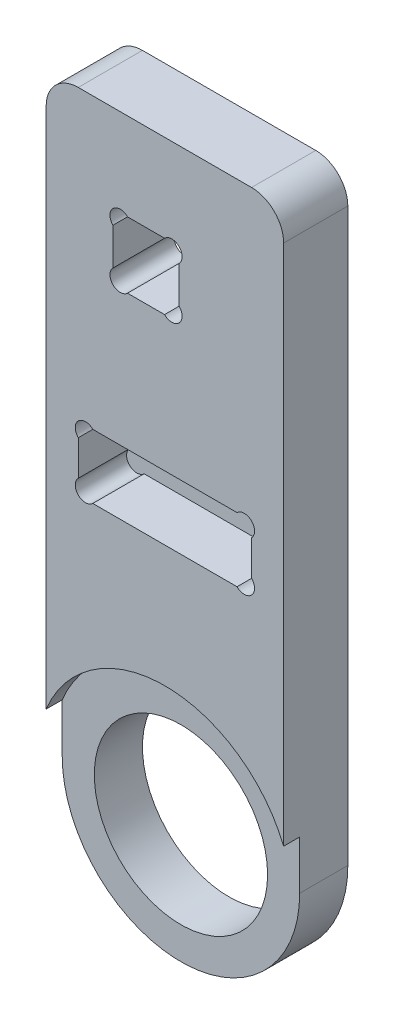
ISO-10303-21;
HEADER;
FILE_DESCRIPTION(('STEP AP214'),'2;1');
FILE_NAME('part.step','',(''),(''),'','','');
FILE_SCHEMA(('AUTOMOTIVE_DESIGN { 1 0 10303 214 1 1 1 1 }'));
ENDSEC;
DATA;
#1=APPLICATION_CONTEXT('core data for automotive mechanical design processes');
#2=APPLICATION_PROTOCOL_DEFINITION('international standard','automotive_design',2000,#1);
#3=PRODUCT_CONTEXT('',#1,'mechanical');
#4=PRODUCT('Part','Part','',(#3));
#5=PRODUCT_RELATED_PRODUCT_CATEGORY('part','',(#4));
#6=PRODUCT_DEFINITION_FORMATION('','',#4);
#7=PRODUCT_DEFINITION_CONTEXT('part definition',#1,'design');
#8=PRODUCT_DEFINITION('design','',#6,#7);
#9=PRODUCT_DEFINITION_SHAPE('','',#8);
#10=(LENGTH_UNIT() NAMED_UNIT(*) SI_UNIT(.MILLI.,.METRE.));
#11=(NAMED_UNIT(*) PLANE_ANGLE_UNIT() SI_UNIT($,.RADIAN.));
#12=(NAMED_UNIT(*) SI_UNIT($,.STERADIAN.) SOLID_ANGLE_UNIT());
#13=UNCERTAINTY_MEASURE_WITH_UNIT(LENGTH_MEASURE(1.E-05),#10,'distance_accuracy_value','');
#14=(GEOMETRIC_REPRESENTATION_CONTEXT(3) GLOBAL_UNCERTAINTY_ASSIGNED_CONTEXT((#13)) GLOBAL_UNIT_ASSIGNED_CONTEXT((#10,
#11,#12)) REPRESENTATION_CONTEXT('',''));
#15=CARTESIAN_POINT('',(0.,0.,0.));
#16=DIRECTION('',(0.,0.,1.));
#17=DIRECTION('',(1.,0.,0.));
#18=AXIS2_PLACEMENT_3D('',#15,#16,#17);
#19=CARTESIAN_POINT('',(0.,0.,10.));
#20=DIRECTION('',(0.,0.,-1.));
#21=DIRECTION('',(-1.,0.,0.));
#22=AXIS2_PLACEMENT_3D('',#19,#20,#21);
#23=CYLINDRICAL_SURFACE('',#22,18.5);
#24=CARTESIAN_POINT('',(0.,0.,7.5));
#25=DIRECTION('',(0.,0.,1.));
#26=DIRECTION('',(1.,0.,0.));
#27=AXIS2_PLACEMENT_3D('',#24,#25,#26);
#28=CIRCLE('',#27,18.5);
#29=CARTESIAN_POINT('',(-18.5,0.,7.5));
#30=VERTEX_POINT('',#29);
#31=CARTESIAN_POINT('',(18.5,0.,7.5));
#32=VERTEX_POINT('',#31);
#33=EDGE_CURVE('E283',#30,#32,#28,.T.);
#34=ORIENTED_EDGE('',*,*,#33,.F.);
#35=DIRECTION('',(0.,0.,1.));
#36=VECTOR('',#35,1.);
#37=CARTESIAN_POINT('',(-18.5,0.,0.));
#38=LINE('',#37,#36);
#39=CARTESIAN_POINT('',(-18.5,0.,0.));
#40=VERTEX_POINT('',#39);
#41=EDGE_CURVE('E368',#40,#30,#38,.T.);
#42=ORIENTED_EDGE('',*,*,#41,.F.);
#43=CARTESIAN_POINT('',(0.,0.,0.));
#44=DIRECTION('',(0.,0.,1.));
#45=DIRECTION('',(1.,0.,0.));
#46=AXIS2_PLACEMENT_3D('',#43,#44,#45);
#47=CIRCLE('',#46,18.5);
#48=CARTESIAN_POINT('',(18.5,0.,0.));
#49=VERTEX_POINT('',#48);
#50=EDGE_CURVE('E371',#40,#49,#47,.T.);
#51=ORIENTED_EDGE('',*,*,#50,.T.);
#52=DIRECTION('',(0.,0.,1.));
#53=VECTOR('',#52,1.);
#54=CARTESIAN_POINT('',(18.5,0.,0.));
#55=LINE('',#54,#53);
#56=EDGE_CURVE('E364',#49,#32,#55,.T.);
#57=ORIENTED_EDGE('',*,*,#56,.T.);
#58=EDGE_LOOP('',(#34,#42,#51,#57));
#59=FACE_BOUND('',#58,.T.);
#60=ADVANCED_FACE('F32',(#59),#23,.T.);
#61=CARTESIAN_POINT('',(0.,0.,0.));
#62=DIRECTION('',(0.,0.,1.));
#63=DIRECTION('',(1.,0.,0.));
#64=AXIS2_PLACEMENT_3D('',#61,#62,#63);
#65=CYLINDRICAL_SURFACE('',#64,13.5);
#66=CARTESIAN_POINT('',(0.,0.,0.));
#67=DIRECTION('',(0.,0.,1.));
#68=DIRECTION('',(1.,0.,0.));
#69=AXIS2_PLACEMENT_3D('',#66,#67,#68);
#70=CIRCLE('',#69,13.5);
#71=CARTESIAN_POINT('',(13.5,0.,0.));
#72=VERTEX_POINT('',#71);
#73=EDGE_CURVE('E340',#72,#72,#70,.T.);
#74=ORIENTED_EDGE('',*,*,#73,.F.);
#75=EDGE_LOOP('',(#74));
#76=FACE_BOUND('',#75,.T.);
#77=CARTESIAN_POINT('',(0.,0.,7.5));
#78=DIRECTION('',(0.,0.,1.));
#79=DIRECTION('',(1.,0.,0.));
#80=AXIS2_PLACEMENT_3D('',#77,#78,#79);
#81=CIRCLE('',#80,13.5);
#82=CARTESIAN_POINT('',(13.5,0.,7.5));
#83=VERTEX_POINT('',#82);
#84=EDGE_CURVE('E277',#83,#83,#81,.F.);
#85=ORIENTED_EDGE('',*,*,#84,.F.);
#86=EDGE_LOOP('',(#85));
#87=FACE_BOUND('',#86,.T.);
#88=ADVANCED_FACE('F424',(#76,#87),#65,.F.);
#89=CARTESIAN_POINT('',(0.,0.,10.));
#90=DIRECTION('',(0.,0.,1.));
#91=DIRECTION('',(1.,0.,0.));
#92=AXIS2_PLACEMENT_3D('',#89,#90,#91);
#93=PLANE('',#92);
#94=DIRECTION('',(0.,1.,0.));
#95=VECTOR('',#94,1.);
#96=CARTESIAN_POINT('',(18.5,94.98,10.));
#97=LINE('',#96,#95);
#98=CARTESIAN_POINT('',(18.5,7.59934207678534,10.));
#99=VERTEX_POINT('',#98);
#100=CARTESIAN_POINT('',(18.5,88.98,10.));
#101=VERTEX_POINT('',#100);
#102=EDGE_CURVE('E357',#99,#101,#97,.T.);
#103=ORIENTED_EDGE('',*,*,#102,.T.);
#104=CARTESIAN_POINT('',(13.5,88.98,10.));
#105=DIRECTION('',(0.,0.,1.));
#106=DIRECTION('',(1.,0.,0.));
#107=AXIS2_PLACEMENT_3D('',#104,#105,#106);
#108=CIRCLE('',#107,5.);
#109=CARTESIAN_POINT('',(13.5,93.98,10.));
#110=VERTEX_POINT('',#109);
#111=EDGE_CURVE('E385',#101,#110,#108,.T.);
#112=ORIENTED_EDGE('',*,*,#111,.T.);
#113=DIRECTION('',(1.,0.,0.));
#114=VECTOR('',#113,1.);
#115=CARTESIAN_POINT('',(-18.5,93.98,10.));
#116=LINE('',#115,#114);
#117=CARTESIAN_POINT('',(-13.5,93.98,10.));
#118=VERTEX_POINT('',#117);
#119=EDGE_CURVE('E226',#118,#110,#116,.T.);
#120=ORIENTED_EDGE('',*,*,#119,.F.);
#121=CARTESIAN_POINT('',(-13.5,88.98,10.));
#122=DIRECTION('',(0.,0.,1.));
#123=DIRECTION('',(1.,0.,0.));
#124=AXIS2_PLACEMENT_3D('',#121,#122,#123);
#125=CIRCLE('',#124,5.);
#126=CARTESIAN_POINT('',(-18.5,88.98,10.));
#127=VERTEX_POINT('',#126);
#128=EDGE_CURVE('E383',#118,#127,#125,.T.);
#129=ORIENTED_EDGE('',*,*,#128,.T.);
#130=DIRECTION('',(0.,-1.,0.));
#131=VECTOR('',#130,1.);
#132=CARTESIAN_POINT('',(-18.5,0.,10.));
#133=LINE('',#132,#131);
#134=CARTESIAN_POINT('',(-18.5,7.59934207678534,10.));
#135=VERTEX_POINT('',#134);
#136=EDGE_CURVE('E362',#127,#135,#133,.T.);
#137=ORIENTED_EDGE('',*,*,#136,.T.);
#138=CARTESIAN_POINT('',(0.,0.,10.));
#139=DIRECTION('',(0.,0.,1.));
#140=DIRECTION('',(1.,0.,0.));
#141=AXIS2_PLACEMENT_3D('',#138,#139,#140);
#142=CIRCLE('',#141,20.);
#143=EDGE_CURVE('E262',#99,#135,#142,.T.);
#144=ORIENTED_EDGE('',*,*,#143,.F.);
#145=EDGE_LOOP('',(#103,#112,#120,#129,#137,#144));
#146=FACE_BOUND('',#145,.T.);
#147=CARTESIAN_POINT('',(-6.961438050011,79.2224839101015,10.));
#148=DIRECTION('',(0.,0.,1.));
#149=DIRECTION('',(-1.,0.,0.));
#150=AXIS2_PLACEMENT_3D('',#147,#148,#149);
#151=CIRCLE('',#150,1.59999999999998);
#152=CARTESIAN_POINT('',(-5.83006720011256,80.35385476,10.));
#153=VERTEX_POINT('',#152);
#154=CARTESIAN_POINT('',(-8.09280889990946,78.0911130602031,10.));
#155=VERTEX_POINT('',#154);
#156=EDGE_CURVE('E201',#153,#155,#151,.T.);
#157=ORIENTED_EDGE('',*,*,#156,.F.);
#158=DIRECTION('',(-1.,0.,0.));
#159=VECTOR('',#158,1.);
#160=CARTESIAN_POINT('',(-5.83006720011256,80.35385476,10.));
#161=LINE('',#160,#159);
#162=CARTESIAN_POINT('',(-0.0555505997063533,80.35385476,10.));
#163=VERTEX_POINT('',#162);
#164=EDGE_CURVE('E220',#163,#153,#161,.T.);
#165=ORIENTED_EDGE('',*,*,#164,.F.);
#166=CARTESIAN_POINT('',(1.07582025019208,79.2224839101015,10.));
#167=DIRECTION('',(0.,0.,1.));
#168=DIRECTION('',(1.,0.,0.));
#169=AXIS2_PLACEMENT_3D('',#166,#167,#168);
#170=CIRCLE('',#169,1.59999999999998);
#171=CARTESIAN_POINT('',(2.20719110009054,78.0911130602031,10.));
#172=VERTEX_POINT('',#171);
#173=EDGE_CURVE('E223',#172,#163,#170,.T.);
#174=ORIENTED_EDGE('',*,*,#173,.F.);
#175=DIRECTION('',(0.,1.,0.));
#176=VECTOR('',#175,1.);
#177=CARTESIAN_POINT('',(2.20719110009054,78.0911130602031,10.));
#178=LINE('',#177,#176);
#179=CARTESIAN_POINT('',(2.20719110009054,72.3165964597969,10.));
#180=VERTEX_POINT('',#179);
#181=EDGE_CURVE('E255',#180,#172,#178,.T.);
#182=ORIENTED_EDGE('',*,*,#181,.F.);
#183=CARTESIAN_POINT('',(1.07582025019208,71.1852256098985,10.));
#184=DIRECTION('',(0.,0.,1.));
#185=DIRECTION('',(-1.,0.,0.));
#186=AXIS2_PLACEMENT_3D('',#183,#184,#185);
#187=CIRCLE('',#186,1.59999999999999);
#188=CARTESIAN_POINT('',(-0.0555505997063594,70.05385476,10.));
#189=VERTEX_POINT('',#188);
#190=EDGE_CURVE('E252',#189,#180,#187,.T.);
#191=ORIENTED_EDGE('',*,*,#190,.F.);
#192=DIRECTION('',(1.,0.,0.));
#193=VECTOR('',#192,1.);
#194=CARTESIAN_POINT('',(-5.83006720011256,70.05385476,10.));
#195=LINE('',#194,#193);
#196=CARTESIAN_POINT('',(-5.83006720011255,70.05385476,10.));
#197=VERTEX_POINT('',#196);
#198=EDGE_CURVE('E249',#197,#189,#195,.T.);
#199=ORIENTED_EDGE('',*,*,#198,.F.);
#200=CARTESIAN_POINT('',(-6.961438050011,71.1852256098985,10.));
#201=DIRECTION('',(0.,0.,1.));
#202=DIRECTION('',(1.,0.,0.));
#203=AXIS2_PLACEMENT_3D('',#200,#201,#202);
#204=CIRCLE('',#203,1.59999999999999);
#205=CARTESIAN_POINT('',(-8.09280889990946,72.316596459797,10.));
#206=VERTEX_POINT('',#205);
#207=EDGE_CURVE('E246',#206,#197,#204,.T.);
#208=ORIENTED_EDGE('',*,*,#207,.F.);
#209=DIRECTION('',(0.,-1.,0.));
#210=VECTOR('',#209,1.);
#211=CARTESIAN_POINT('',(-8.09280889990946,78.0911130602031,10.));
#212=LINE('',#211,#210);
#213=EDGE_CURVE('E243',#155,#206,#212,.T.);
#214=ORIENTED_EDGE('',*,*,#213,.F.);
#215=EDGE_LOOP('',(#157,#165,#174,#182,#191,#199,#208,#214));
#216=FACE_BOUND('',#215,.T.);
#217=CARTESIAN_POINT('',(-12.3686291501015,47.8486291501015,10.));
#218=DIRECTION('',(0.,0.,1.));
#219=DIRECTION('',(1.,0.,0.));
#220=AXIS2_PLACEMENT_3D('',#217,#218,#219);
#221=CIRCLE('',#220,1.6);
#222=CARTESIAN_POINT('',(-11.2372583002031,48.98,10.));
#223=VERTEX_POINT('',#222);
#224=CARTESIAN_POINT('',(-13.5,46.717258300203,10.));
#225=VERTEX_POINT('',#224);
#226=EDGE_CURVE('E290',#223,#225,#221,.T.);
#227=ORIENTED_EDGE('',*,*,#226,.F.);
#228=DIRECTION('',(-1.,0.,0.));
#229=VECTOR('',#228,1.);
#230=CARTESIAN_POINT('',(-11.2372583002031,48.98,10.));
#231=LINE('',#230,#229);
#232=CARTESIAN_POINT('',(11.2372583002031,48.98,10.));
#233=VERTEX_POINT('',#232);
#234=EDGE_CURVE('E295',#233,#223,#231,.T.);
#235=ORIENTED_EDGE('',*,*,#234,.F.);
#236=CARTESIAN_POINT('',(12.3686291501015,47.8486291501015,10.));
#237=DIRECTION('',(0.,0.,1.));
#238=DIRECTION('',(-1.,0.,0.));
#239=AXIS2_PLACEMENT_3D('',#236,#237,#238);
#240=CIRCLE('',#239,1.6);
#241=CARTESIAN_POINT('',(13.5,46.7172583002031,10.));
#242=VERTEX_POINT('',#241);
#243=EDGE_CURVE('E333',#242,#233,#240,.T.);
#244=ORIENTED_EDGE('',*,*,#243,.F.);
#245=DIRECTION('',(0.,1.,0.));
#246=VECTOR('',#245,1.);
#247=CARTESIAN_POINT('',(13.5,46.7172583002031,10.));
#248=LINE('',#247,#246);
#249=CARTESIAN_POINT('',(13.5,41.242741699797,10.));
#250=VERTEX_POINT('',#249);
#251=EDGE_CURVE('E330',#250,#242,#248,.T.);
#252=ORIENTED_EDGE('',*,*,#251,.F.);
#253=CARTESIAN_POINT('',(12.3686291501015,40.1113708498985,10.));
#254=DIRECTION('',(0.,0.,1.));
#255=DIRECTION('',(1.,0.,0.));
#256=AXIS2_PLACEMENT_3D('',#253,#254,#255);
#257=CIRCLE('',#256,1.6);
#258=CARTESIAN_POINT('',(11.2372583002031,38.98,10.));
#259=VERTEX_POINT('',#258);
#260=EDGE_CURVE('E327',#259,#250,#257,.T.);
#261=ORIENTED_EDGE('',*,*,#260,.F.);
#262=DIRECTION('',(1.,0.,0.));
#263=VECTOR('',#262,1.);
#264=CARTESIAN_POINT('',(-11.2372583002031,38.98,10.));
#265=LINE('',#264,#263);
#266=CARTESIAN_POINT('',(-11.2372583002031,38.98,10.));
#267=VERTEX_POINT('',#266);
#268=EDGE_CURVE('E324',#267,#259,#265,.T.);
#269=ORIENTED_EDGE('',*,*,#268,.F.);
#270=CARTESIAN_POINT('',(-12.3686291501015,40.1113708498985,10.));
#271=DIRECTION('',(0.,0.,1.));
#272=DIRECTION('',(-1.,0.,0.));
#273=AXIS2_PLACEMENT_3D('',#270,#271,#272);
#274=CIRCLE('',#273,1.6);
#275=CARTESIAN_POINT('',(-13.5,41.242741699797,10.));
#276=VERTEX_POINT('',#275);
#277=EDGE_CURVE('E321',#276,#267,#274,.T.);
#278=ORIENTED_EDGE('',*,*,#277,.F.);
#279=DIRECTION('',(0.,-1.,0.));
#280=VECTOR('',#279,1.);
#281=CARTESIAN_POINT('',(-13.5,46.717258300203,10.));
#282=LINE('',#281,#280);
#283=EDGE_CURVE('E318',#225,#276,#282,.T.);
#284=ORIENTED_EDGE('',*,*,#283,.F.);
#285=EDGE_LOOP('',(#227,#235,#244,#252,#261,#269,#278,#284));
#286=FACE_BOUND('',#285,.T.);
#287=ADVANCED_FACE('F404',(#146,#216,#286),#93,.T.);
#288=CARTESIAN_POINT('',(0.,0.,0.));
#289=DIRECTION('',(0.,0.,1.));
#290=DIRECTION('',(1.,0.,0.));
#291=AXIS2_PLACEMENT_3D('',#288,#289,#290);
#292=PLANE('',#291);
#293=DIRECTION('',(-1.,0.,0.));
#294=VECTOR('',#293,1.);
#295=CARTESIAN_POINT('',(-5.83006720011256,80.35385476,0.));
#296=LINE('',#295,#294);
#297=CARTESIAN_POINT('',(-0.0555505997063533,80.35385476,0.));
#298=VERTEX_POINT('',#297);
#299=CARTESIAN_POINT('',(-5.83006720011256,80.35385476,0.));
#300=VERTEX_POINT('',#299);
#301=EDGE_CURVE('E206',#298,#300,#296,.T.);
#302=ORIENTED_EDGE('',*,*,#301,.T.);
#303=CARTESIAN_POINT('',(-6.961438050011,79.2224839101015,0.));
#304=DIRECTION('',(0.,0.,1.));
#305=DIRECTION('',(-1.,0.,0.));
#306=AXIS2_PLACEMENT_3D('',#303,#304,#305);
#307=CIRCLE('',#306,1.59999999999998);
#308=CARTESIAN_POINT('',(-8.09280889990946,78.0911130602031,0.));
#309=VERTEX_POINT('',#308);
#310=EDGE_CURVE('E198',#300,#309,#307,.T.);
#311=ORIENTED_EDGE('',*,*,#310,.T.);
#312=DIRECTION('',(0.,-1.,0.));
#313=VECTOR('',#312,1.);
#314=CARTESIAN_POINT('',(-8.09280889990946,78.0911130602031,0.));
#315=LINE('',#314,#313);
#316=CARTESIAN_POINT('',(-8.09280889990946,72.316596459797,0.));
#317=VERTEX_POINT('',#316);
#318=EDGE_CURVE('E210',#309,#317,#315,.T.);
#319=ORIENTED_EDGE('',*,*,#318,.T.);
#320=CARTESIAN_POINT('',(-6.961438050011,71.1852256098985,0.));
#321=DIRECTION('',(0.,0.,1.));
#322=DIRECTION('',(1.,0.,0.));
#323=AXIS2_PLACEMENT_3D('',#320,#321,#322);
#324=CIRCLE('',#323,1.59999999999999);
#325=CARTESIAN_POINT('',(-5.83006720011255,70.05385476,0.));
#326=VERTEX_POINT('',#325);
#327=EDGE_CURVE('E214',#317,#326,#324,.T.);
#328=ORIENTED_EDGE('',*,*,#327,.T.);
#329=DIRECTION('',(1.,0.,0.));
#330=VECTOR('',#329,1.);
#331=CARTESIAN_POINT('',(-5.83006720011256,70.05385476,0.));
#332=LINE('',#331,#330);
#333=CARTESIAN_POINT('',(-0.0555505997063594,70.05385476,0.));
#334=VERTEX_POINT('',#333);
#335=EDGE_CURVE('E230',#326,#334,#332,.T.);
#336=ORIENTED_EDGE('',*,*,#335,.T.);
#337=CARTESIAN_POINT('',(1.07582025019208,71.1852256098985,0.));
#338=DIRECTION('',(0.,0.,1.));
#339=DIRECTION('',(-1.,0.,0.));
#340=AXIS2_PLACEMENT_3D('',#337,#338,#339);
#341=CIRCLE('',#340,1.59999999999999);
#342=CARTESIAN_POINT('',(2.20719110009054,72.3165964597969,0.));
#343=VERTEX_POINT('',#342);
#344=EDGE_CURVE('E233',#334,#343,#341,.T.);
#345=ORIENTED_EDGE('',*,*,#344,.T.);
#346=DIRECTION('',(0.,1.,0.));
#347=VECTOR('',#346,1.);
#348=CARTESIAN_POINT('',(2.20719110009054,78.0911130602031,0.));
#349=LINE('',#348,#347);
#350=CARTESIAN_POINT('',(2.20719110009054,78.0911130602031,0.));
#351=VERTEX_POINT('',#350);
#352=EDGE_CURVE('E236',#343,#351,#349,.T.);
#353=ORIENTED_EDGE('',*,*,#352,.T.);
#354=CARTESIAN_POINT('',(1.07582025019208,79.2224839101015,0.));
#355=DIRECTION('',(0.,0.,1.));
#356=DIRECTION('',(1.,0.,0.));
#357=AXIS2_PLACEMENT_3D('',#354,#355,#356);
#358=CIRCLE('',#357,1.59999999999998);
#359=EDGE_CURVE('E239',#351,#298,#358,.T.);
#360=ORIENTED_EDGE('',*,*,#359,.T.);
#361=EDGE_LOOP('',(#302,#311,#319,#328,#336,#345,#353,#360));
#362=FACE_BOUND('',#361,.T.);
#363=ORIENTED_EDGE('',*,*,#73,.T.);
#364=EDGE_LOOP('',(#363));
#365=FACE_BOUND('',#364,.T.);
#366=DIRECTION('',(1.,0.,0.));
#367=VECTOR('',#366,1.);
#368=CARTESIAN_POINT('',(-18.5,93.98,0.));
#369=LINE('',#368,#367);
#370=CARTESIAN_POINT('',(-13.5,93.98,0.));
#371=VERTEX_POINT('',#370);
#372=CARTESIAN_POINT('',(13.5,93.98,0.));
#373=VERTEX_POINT('',#372);
#374=EDGE_CURVE('E244',#371,#373,#369,.T.);
#375=ORIENTED_EDGE('',*,*,#374,.T.);
#376=CARTESIAN_POINT('',(13.5,88.98,0.));
#377=DIRECTION('',(0.,0.,1.));
#378=DIRECTION('',(1.,0.,0.));
#379=AXIS2_PLACEMENT_3D('',#376,#377,#378);
#380=CIRCLE('',#379,5.);
#381=CARTESIAN_POINT('',(18.5,88.98,0.));
#382=VERTEX_POINT('',#381);
#383=EDGE_CURVE('E40',#373,#382,#380,.F.);
#384=ORIENTED_EDGE('',*,*,#383,.T.);
#385=DIRECTION('',(0.,1.,0.));
#386=VECTOR('',#385,1.);
#387=CARTESIAN_POINT('',(18.5,94.98,0.));
#388=LINE('',#387,#386);
#389=EDGE_CURVE('E358',#49,#382,#388,.T.);
#390=ORIENTED_EDGE('',*,*,#389,.F.);
#391=ORIENTED_EDGE('',*,*,#50,.F.);
#392=DIRECTION('',(0.,-1.,0.));
#393=VECTOR('',#392,1.);
#394=CARTESIAN_POINT('',(-18.5,0.,0.));
#395=LINE('',#394,#393);
#396=CARTESIAN_POINT('',(-18.5,88.98,0.));
#397=VERTEX_POINT('',#396);
#398=EDGE_CURVE('E361',#397,#40,#395,.T.);
#399=ORIENTED_EDGE('',*,*,#398,.F.);
#400=CARTESIAN_POINT('',(-13.5,88.98,0.));
#401=DIRECTION('',(0.,0.,1.));
#402=DIRECTION('',(1.,0.,0.));
#403=AXIS2_PLACEMENT_3D('',#400,#401,#402);
#404=CIRCLE('',#403,5.);
#405=EDGE_CURVE('E391',#397,#371,#404,.F.);
#406=ORIENTED_EDGE('',*,*,#405,.T.);
#407=EDGE_LOOP('',(#375,#384,#390,#391,#399,#406));
#408=FACE_BOUND('',#407,.T.);
#409=ADVANCED_FACE('F216',(#362,#365,#408),#292,.F.);
#410=CARTESIAN_POINT('',(-18.5,0.,0.));
#411=DIRECTION('',(-1.,0.,0.));
#412=DIRECTION('',(0.,-1.,0.));
#413=AXIS2_PLACEMENT_3D('',#410,#411,#412);
#414=PLANE('',#413);
#415=ORIENTED_EDGE('',*,*,#136,.F.);
#416=DIRECTION('',(0.,0.,1.));
#417=VECTOR('',#416,1.);
#418=CARTESIAN_POINT('',(-18.5,88.98,0.));
#419=LINE('',#418,#417);
#420=EDGE_CURVE('E11',#127,#397,#419,.F.);
#421=ORIENTED_EDGE('',*,*,#420,.T.);
#422=ORIENTED_EDGE('',*,*,#398,.T.);
#423=ORIENTED_EDGE('',*,*,#41,.T.);
#424=DIRECTION('',(0.,1.,0.));
#425=VECTOR('',#424,1.);
#426=CARTESIAN_POINT('',(-18.5,0.,7.5));
#427=LINE('',#426,#425);
#428=CARTESIAN_POINT('',(-18.5,7.59934207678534,7.5));
#429=VERTEX_POINT('',#428);
#430=EDGE_CURVE('E285',#30,#429,#427,.T.);
#431=ORIENTED_EDGE('',*,*,#430,.T.);
#432=DIRECTION('',(0.,0.,1.));
#433=VECTOR('',#432,1.);
#434=CARTESIAN_POINT('',(-18.5,7.59934207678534,7.5));
#435=LINE('',#434,#433);
#436=EDGE_CURVE('E288',#135,#429,#435,.F.);
#437=ORIENTED_EDGE('',*,*,#436,.F.);
#438=EDGE_LOOP('',(#415,#421,#422,#423,#431,#437));
#439=FACE_BOUND('',#438,.T.);
#440=ADVANCED_FACE('F412',(#439),#414,.T.);
#441=CARTESIAN_POINT('',(18.5,94.98,0.));
#442=DIRECTION('',(1.,0.,0.));
#443=DIRECTION('',(0.,1.,0.));
#444=AXIS2_PLACEMENT_3D('',#441,#442,#443);
#445=PLANE('',#444);
#446=ORIENTED_EDGE('',*,*,#389,.T.);
#447=DIRECTION('',(0.,0.,1.));
#448=VECTOR('',#447,1.);
#449=CARTESIAN_POINT('',(18.5,88.98,10.));
#450=LINE('',#449,#448);
#451=EDGE_CURVE('E380',#382,#101,#450,.T.);
#452=ORIENTED_EDGE('',*,*,#451,.T.);
#453=ORIENTED_EDGE('',*,*,#102,.F.);
#454=DIRECTION('',(0.,0.,1.));
#455=VECTOR('',#454,1.);
#456=CARTESIAN_POINT('',(18.5,7.59934207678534,7.5));
#457=LINE('',#456,#455);
#458=CARTESIAN_POINT('',(18.5,7.59934207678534,7.5));
#459=VERTEX_POINT('',#458);
#460=EDGE_CURVE('E376',#459,#99,#457,.T.);
#461=ORIENTED_EDGE('',*,*,#460,.F.);
#462=DIRECTION('',(0.,-1.,0.));
#463=VECTOR('',#462,1.);
#464=CARTESIAN_POINT('',(18.5,94.98,7.5));
#465=LINE('',#464,#463);
#466=EDGE_CURVE('E280',#459,#32,#465,.T.);
#467=ORIENTED_EDGE('',*,*,#466,.T.);
#468=ORIENTED_EDGE('',*,*,#56,.F.);
#469=EDGE_LOOP('',(#446,#452,#453,#461,#467,#468));
#470=FACE_BOUND('',#469,.T.);
#471=ADVANCED_FACE('F399',(#470),#445,.T.);
#472=CARTESIAN_POINT('',(-12.3686291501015,47.8486291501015,2.));
#473=DIRECTION('',(0.,0.,1.));
#474=DIRECTION('',(1.,0.,0.));
#475=AXIS2_PLACEMENT_3D('',#472,#473,#474);
#476=CYLINDRICAL_SURFACE('',#475,1.6);
#477=ORIENTED_EDGE('',*,*,#226,.T.);
#478=DIRECTION('',(0.,0.,1.));
#479=VECTOR('',#478,1.);
#480=CARTESIAN_POINT('',(-13.5,46.717258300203,2.));
#481=LINE('',#480,#479);
#482=CARTESIAN_POINT('',(-13.5,46.717258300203,2.));
#483=VERTEX_POINT('',#482);
#484=EDGE_CURVE('E316',#483,#225,#481,.T.);
#485=ORIENTED_EDGE('',*,*,#484,.F.);
#486=CARTESIAN_POINT('',(-12.3686291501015,47.8486291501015,2.));
#487=DIRECTION('',(0.,0.,1.));
#488=DIRECTION('',(1.,0.,0.));
#489=AXIS2_PLACEMENT_3D('',#486,#487,#488);
#490=CIRCLE('',#489,1.6);
#491=CARTESIAN_POINT('',(-11.2372583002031,48.98,2.));
#492=VERTEX_POINT('',#491);
#493=EDGE_CURVE('E291',#492,#483,#490,.T.);
#494=ORIENTED_EDGE('',*,*,#493,.F.);
#495=DIRECTION('',(0.,0.,1.));
#496=VECTOR('',#495,1.);
#497=CARTESIAN_POINT('',(-11.2372583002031,48.98,2.));
#498=LINE('',#497,#496);
#499=EDGE_CURVE('E338',#492,#223,#498,.T.);
#500=ORIENTED_EDGE('',*,*,#499,.T.);
#501=EDGE_LOOP('',(#477,#485,#494,#500));
#502=FACE_BOUND('',#501,.T.);
#503=ADVANCED_FACE('F483',(#502),#476,.F.);
#504=CARTESIAN_POINT('',(-11.2372583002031,48.98,2.));
#505=DIRECTION('',(0.,1.,0.));
#506=DIRECTION('',(-1.,0.,0.));
#507=AXIS2_PLACEMENT_3D('',#504,#505,#506);
#508=PLANE('',#507);
#509=ORIENTED_EDGE('',*,*,#234,.T.);
#510=ORIENTED_EDGE('',*,*,#499,.F.);
#511=DIRECTION('',(-1.,0.,0.));
#512=VECTOR('',#511,1.);
#513=CARTESIAN_POINT('',(-11.2372583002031,48.98,2.));
#514=LINE('',#513,#512);
#515=CARTESIAN_POINT('',(11.2372583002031,48.98,2.));
#516=VERTEX_POINT('',#515);
#517=EDGE_CURVE('E313',#516,#492,#514,.T.);
#518=ORIENTED_EDGE('',*,*,#517,.F.);
#519=DIRECTION('',(0.,0.,1.));
#520=VECTOR('',#519,1.);
#521=CARTESIAN_POINT('',(11.2372583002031,48.98,2.));
#522=LINE('',#521,#520);
#523=EDGE_CURVE('E341',#516,#233,#522,.T.);
#524=ORIENTED_EDGE('',*,*,#523,.T.);
#525=EDGE_LOOP('',(#509,#510,#518,#524));
#526=FACE_BOUND('',#525,.T.);
#527=ADVANCED_FACE('F479',(#526),#508,.F.);
#528=CARTESIAN_POINT('',(12.3686291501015,47.8486291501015,2.));
#529=DIRECTION('',(0.,0.,1.));
#530=DIRECTION('',(1.,0.,0.));
#531=AXIS2_PLACEMENT_3D('',#528,#529,#530);
#532=CYLINDRICAL_SURFACE('',#531,1.6);
#533=ORIENTED_EDGE('',*,*,#243,.T.);
#534=ORIENTED_EDGE('',*,*,#523,.F.);
#535=CARTESIAN_POINT('',(12.3686291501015,47.8486291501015,2.));
#536=DIRECTION('',(0.,0.,1.));
#537=DIRECTION('',(-1.,0.,0.));
#538=AXIS2_PLACEMENT_3D('',#535,#536,#537);
#539=CIRCLE('',#538,1.6);
#540=CARTESIAN_POINT('',(13.5,46.7172583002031,2.));
#541=VERTEX_POINT('',#540);
#542=EDGE_CURVE('E310',#541,#516,#539,.T.);
#543=ORIENTED_EDGE('',*,*,#542,.F.);
#544=DIRECTION('',(0.,0.,1.));
#545=VECTOR('',#544,1.);
#546=CARTESIAN_POINT('',(13.5,46.7172583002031,2.));
#547=LINE('',#546,#545);
#548=EDGE_CURVE('E343',#541,#242,#547,.T.);
#549=ORIENTED_EDGE('',*,*,#548,.T.);
#550=EDGE_LOOP('',(#533,#534,#543,#549));
#551=FACE_BOUND('',#550,.T.);
#552=ADVANCED_FACE('F482',(#551),#532,.F.);
#553=CARTESIAN_POINT('',(13.5,46.7172583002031,2.));
#554=DIRECTION('',(1.,0.,0.));
#555=DIRECTION('',(0.,1.,0.));
#556=AXIS2_PLACEMENT_3D('',#553,#554,#555);
#557=PLANE('',#556);
#558=ORIENTED_EDGE('',*,*,#251,.T.);
#559=ORIENTED_EDGE('',*,*,#548,.F.);
#560=DIRECTION('',(0.,1.,0.));
#561=VECTOR('',#560,1.);
#562=CARTESIAN_POINT('',(13.5,46.7172583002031,2.));
#563=LINE('',#562,#561);
#564=CARTESIAN_POINT('',(13.5,41.242741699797,2.));
#565=VERTEX_POINT('',#564);
#566=EDGE_CURVE('E307',#565,#541,#563,.T.);
#567=ORIENTED_EDGE('',*,*,#566,.F.);
#568=DIRECTION('',(0.,0.,1.));
#569=VECTOR('',#568,1.);
#570=CARTESIAN_POINT('',(13.5,41.242741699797,2.));
#571=LINE('',#570,#569);
#572=EDGE_CURVE('E345',#565,#250,#571,.T.);
#573=ORIENTED_EDGE('',*,*,#572,.T.);
#574=EDGE_LOOP('',(#558,#559,#567,#573));
#575=FACE_BOUND('',#574,.T.);
#576=ADVANCED_FACE('F487',(#575),#557,.F.);
#577=CARTESIAN_POINT('',(12.3686291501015,40.1113708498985,2.));
#578=DIRECTION('',(0.,0.,1.));
#579=DIRECTION('',(1.,0.,0.));
#580=AXIS2_PLACEMENT_3D('',#577,#578,#579);
#581=CYLINDRICAL_SURFACE('',#580,1.6);
#582=ORIENTED_EDGE('',*,*,#260,.T.);
#583=ORIENTED_EDGE('',*,*,#572,.F.);
#584=CARTESIAN_POINT('',(12.3686291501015,40.1113708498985,2.));
#585=DIRECTION('',(0.,0.,1.));
#586=DIRECTION('',(1.,0.,0.));
#587=AXIS2_PLACEMENT_3D('',#584,#585,#586);
#588=CIRCLE('',#587,1.6);
#589=CARTESIAN_POINT('',(11.2372583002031,38.98,2.));
#590=VERTEX_POINT('',#589);
#591=EDGE_CURVE('E304',#590,#565,#588,.T.);
#592=ORIENTED_EDGE('',*,*,#591,.F.);
#593=DIRECTION('',(0.,0.,1.));
#594=VECTOR('',#593,1.);
#595=CARTESIAN_POINT('',(11.2372583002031,38.98,2.));
#596=LINE('',#595,#594);
#597=EDGE_CURVE('E347',#590,#259,#596,.T.);
#598=ORIENTED_EDGE('',*,*,#597,.T.);
#599=EDGE_LOOP('',(#582,#583,#592,#598));
#600=FACE_BOUND('',#599,.T.);
#601=ADVANCED_FACE('F491',(#600),#581,.F.);
#602=CARTESIAN_POINT('',(-11.2372583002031,38.98,2.));
#603=DIRECTION('',(0.,-1.,0.));
#604=DIRECTION('',(0.,0.,-1.));
#605=AXIS2_PLACEMENT_3D('',#602,#603,#604);
#606=PLANE('',#605);
#607=ORIENTED_EDGE('',*,*,#268,.T.);
#608=ORIENTED_EDGE('',*,*,#597,.F.);
#609=DIRECTION('',(1.,0.,0.));
#610=VECTOR('',#609,1.);
#611=CARTESIAN_POINT('',(-11.2372583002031,38.98,2.));
#612=LINE('',#611,#610);
#613=CARTESIAN_POINT('',(-11.2372583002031,38.98,2.));
#614=VERTEX_POINT('',#613);
#615=EDGE_CURVE('E301',#614,#590,#612,.T.);
#616=ORIENTED_EDGE('',*,*,#615,.F.);
#617=DIRECTION('',(0.,0.,1.));
#618=VECTOR('',#617,1.);
#619=CARTESIAN_POINT('',(-11.2372583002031,38.98,2.));
#620=LINE('',#619,#618);
#621=EDGE_CURVE('E349',#614,#267,#620,.T.);
#622=ORIENTED_EDGE('',*,*,#621,.T.);
#623=EDGE_LOOP('',(#607,#608,#616,#622));
#624=FACE_BOUND('',#623,.T.);
#625=ADVANCED_FACE('F495',(#624),#606,.F.);
#626=CARTESIAN_POINT('',(-12.3686291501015,40.1113708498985,2.));
#627=DIRECTION('',(0.,0.,1.));
#628=DIRECTION('',(1.,0.,0.));
#629=AXIS2_PLACEMENT_3D('',#626,#627,#628);
#630=CYLINDRICAL_SURFACE('',#629,1.6);
#631=ORIENTED_EDGE('',*,*,#277,.T.);
#632=ORIENTED_EDGE('',*,*,#621,.F.);
#633=CARTESIAN_POINT('',(-12.3686291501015,40.1113708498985,2.));
#634=DIRECTION('',(0.,0.,1.));
#635=DIRECTION('',(-1.,0.,0.));
#636=AXIS2_PLACEMENT_3D('',#633,#634,#635);
#637=CIRCLE('',#636,1.6);
#638=CARTESIAN_POINT('',(-13.5,41.242741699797,2.));
#639=VERTEX_POINT('',#638);
#640=EDGE_CURVE('E298',#639,#614,#637,.T.);
#641=ORIENTED_EDGE('',*,*,#640,.F.);
#642=DIRECTION('',(0.,0.,1.));
#643=VECTOR('',#642,1.);
#644=CARTESIAN_POINT('',(-13.5,41.242741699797,2.));
#645=LINE('',#644,#643);
#646=EDGE_CURVE('E351',#639,#276,#645,.T.);
#647=ORIENTED_EDGE('',*,*,#646,.T.);
#648=EDGE_LOOP('',(#631,#632,#641,#647));
#649=FACE_BOUND('',#648,.T.);
#650=ADVANCED_FACE('F499',(#649),#630,.F.);
#651=CARTESIAN_POINT('',(-13.5,46.717258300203,2.));
#652=DIRECTION('',(-1.,0.,0.));
#653=DIRECTION('',(0.,0.,1.));
#654=AXIS2_PLACEMENT_3D('',#651,#652,#653);
#655=PLANE('',#654);
#656=ORIENTED_EDGE('',*,*,#283,.T.);
#657=ORIENTED_EDGE('',*,*,#646,.F.);
#658=DIRECTION('',(0.,-1.,0.));
#659=VECTOR('',#658,1.);
#660=CARTESIAN_POINT('',(-13.5,46.717258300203,2.));
#661=LINE('',#660,#659);
#662=EDGE_CURVE('E294',#483,#639,#661,.T.);
#663=ORIENTED_EDGE('',*,*,#662,.F.);
#664=ORIENTED_EDGE('',*,*,#484,.T.);
#665=EDGE_LOOP('',(#656,#657,#663,#664));
#666=FACE_BOUND('',#665,.T.);
#667=ADVANCED_FACE('F477',(#666),#655,.F.);
#668=CARTESIAN_POINT('',(-12.3686291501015,47.8486291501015,2.));
#669=DIRECTION('',(0.,0.,1.));
#670=DIRECTION('',(1.,0.,0.));
#671=AXIS2_PLACEMENT_3D('',#668,#669,#670);
#672=PLANE('',#671);
#673=ORIENTED_EDGE('',*,*,#493,.T.);
#674=ORIENTED_EDGE('',*,*,#662,.T.);
#675=ORIENTED_EDGE('',*,*,#640,.T.);
#676=ORIENTED_EDGE('',*,*,#615,.T.);
#677=ORIENTED_EDGE('',*,*,#591,.T.);
#678=ORIENTED_EDGE('',*,*,#566,.T.);
#679=ORIENTED_EDGE('',*,*,#542,.T.);
#680=ORIENTED_EDGE('',*,*,#517,.T.);
#681=EDGE_LOOP('',(#673,#674,#675,#676,#677,#678,#679,#680));
#682=FACE_BOUND('',#681,.T.);
#683=ADVANCED_FACE('F472',(#682),#672,.T.);
#684=CARTESIAN_POINT('',(0.,0.,7.5));
#685=DIRECTION('',(0.,0.,1.));
#686=DIRECTION('',(1.,0.,0.));
#687=AXIS2_PLACEMENT_3D('',#684,#685,#686);
#688=PLANE('',#687);
#689=ORIENTED_EDGE('',*,*,#33,.T.);
#690=ORIENTED_EDGE('',*,*,#466,.F.);
#691=CARTESIAN_POINT('',(0.,0.,7.5));
#692=DIRECTION('',(0.,0.,1.));
#693=DIRECTION('',(1.,0.,0.));
#694=AXIS2_PLACEMENT_3D('',#691,#692,#693);
#695=CIRCLE('',#694,20.);
#696=EDGE_CURVE('E274',#459,#429,#695,.T.);
#697=ORIENTED_EDGE('',*,*,#696,.T.);
#698=ORIENTED_EDGE('',*,*,#430,.F.);
#699=EDGE_LOOP('',(#689,#690,#697,#698));
#700=FACE_BOUND('',#699,.T.);
#701=ORIENTED_EDGE('',*,*,#84,.T.);
#702=EDGE_LOOP('',(#701));
#703=FACE_BOUND('',#702,.T.);
#704=ADVANCED_FACE('F418',(#700,#703),#688,.T.);
#705=CARTESIAN_POINT('',(0.,0.,7.5));
#706=DIRECTION('',(0.,0.,1.));
#707=DIRECTION('',(1.,0.,0.));
#708=AXIS2_PLACEMENT_3D('',#705,#706,#707);
#709=CYLINDRICAL_SURFACE('',#708,20.);
#710=ORIENTED_EDGE('',*,*,#436,.T.);
#711=ORIENTED_EDGE('',*,*,#696,.F.);
#712=ORIENTED_EDGE('',*,*,#460,.T.);
#713=ORIENTED_EDGE('',*,*,#143,.T.);
#714=EDGE_LOOP('',(#710,#711,#712,#713));
#715=FACE_BOUND('',#714,.T.);
#716=ADVANCED_FACE('F415',(#715),#709,.F.);
#717=CARTESIAN_POINT('',(-6.961438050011,79.2224839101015,0.));
#718=DIRECTION('',(0.,0.,1.));
#719=DIRECTION('',(1.,0.,0.));
#720=AXIS2_PLACEMENT_3D('',#717,#718,#719);
#721=CYLINDRICAL_SURFACE('',#720,1.59999999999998);
#722=ORIENTED_EDGE('',*,*,#156,.T.);
#723=DIRECTION('',(0.,0.,1.));
#724=VECTOR('',#723,1.);
#725=CARTESIAN_POINT('',(-8.09280889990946,78.0911130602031,0.));
#726=LINE('',#725,#724);
#727=EDGE_CURVE('E194',#309,#155,#726,.T.);
#728=ORIENTED_EDGE('',*,*,#727,.F.);
#729=ORIENTED_EDGE('',*,*,#310,.F.);
#730=DIRECTION('',(0.,0.,1.));
#731=VECTOR('',#730,1.);
#732=CARTESIAN_POINT('',(-5.83006720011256,80.35385476,0.));
#733=LINE('',#732,#731);
#734=EDGE_CURVE('E260',#300,#153,#733,.T.);
#735=ORIENTED_EDGE('',*,*,#734,.T.);
#736=EDGE_LOOP('',(#722,#728,#729,#735));
#737=FACE_BOUND('',#736,.T.);
#738=ADVANCED_FACE('F196',(#737),#721,.F.);
#739=CARTESIAN_POINT('',(-5.83006720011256,80.35385476,0.));
#740=DIRECTION('',(0.,1.,0.));
#741=DIRECTION('',(0.,0.,1.));
#742=AXIS2_PLACEMENT_3D('',#739,#740,#741);
#743=PLANE('',#742);
#744=ORIENTED_EDGE('',*,*,#164,.T.);
#745=ORIENTED_EDGE('',*,*,#734,.F.);
#746=ORIENTED_EDGE('',*,*,#301,.F.);
#747=DIRECTION('',(0.,0.,1.));
#748=VECTOR('',#747,1.);
#749=CARTESIAN_POINT('',(-0.0555505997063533,80.35385476,0.));
#750=LINE('',#749,#748);
#751=EDGE_CURVE('E263',#298,#163,#750,.T.);
#752=ORIENTED_EDGE('',*,*,#751,.T.);
#753=EDGE_LOOP('',(#744,#745,#746,#752));
#754=FACE_BOUND('',#753,.T.);
#755=ADVANCED_FACE('F445',(#754),#743,.F.);
#756=CARTESIAN_POINT('',(1.07582025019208,79.2224839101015,0.));
#757=DIRECTION('',(0.,0.,1.));
#758=DIRECTION('',(1.,0.,0.));
#759=AXIS2_PLACEMENT_3D('',#756,#757,#758);
#760=CYLINDRICAL_SURFACE('',#759,1.59999999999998);
#761=ORIENTED_EDGE('',*,*,#173,.T.);
#762=ORIENTED_EDGE('',*,*,#751,.F.);
#763=ORIENTED_EDGE('',*,*,#359,.F.);
#764=DIRECTION('',(0.,0.,1.));
#765=VECTOR('',#764,1.);
#766=CARTESIAN_POINT('',(2.20719110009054,78.0911130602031,0.));
#767=LINE('',#766,#765);
#768=EDGE_CURVE('E265',#351,#172,#767,.T.);
#769=ORIENTED_EDGE('',*,*,#768,.T.);
#770=EDGE_LOOP('',(#761,#762,#763,#769));
#771=FACE_BOUND('',#770,.T.);
#772=ADVANCED_FACE('F448',(#771),#760,.F.);
#773=CARTESIAN_POINT('',(2.20719110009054,78.0911130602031,0.));
#774=DIRECTION('',(1.,0.,0.));
#775=DIRECTION('',(0.,0.,-1.));
#776=AXIS2_PLACEMENT_3D('',#773,#774,#775);
#777=PLANE('',#776);
#778=ORIENTED_EDGE('',*,*,#181,.T.);
#779=ORIENTED_EDGE('',*,*,#768,.F.);
#780=ORIENTED_EDGE('',*,*,#352,.F.);
#781=DIRECTION('',(0.,0.,1.));
#782=VECTOR('',#781,1.);
#783=CARTESIAN_POINT('',(2.20719110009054,72.3165964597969,0.));
#784=LINE('',#783,#782);
#785=EDGE_CURVE('E267',#343,#180,#784,.T.);
#786=ORIENTED_EDGE('',*,*,#785,.T.);
#787=EDGE_LOOP('',(#778,#779,#780,#786));
#788=FACE_BOUND('',#787,.T.);
#789=ADVANCED_FACE('F452',(#788),#777,.F.);
#790=CARTESIAN_POINT('',(1.07582025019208,71.1852256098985,0.));
#791=DIRECTION('',(0.,0.,1.));
#792=DIRECTION('',(1.,0.,0.));
#793=AXIS2_PLACEMENT_3D('',#790,#791,#792);
#794=CYLINDRICAL_SURFACE('',#793,1.59999999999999);
#795=ORIENTED_EDGE('',*,*,#190,.T.);
#796=ORIENTED_EDGE('',*,*,#785,.F.);
#797=ORIENTED_EDGE('',*,*,#344,.F.);
#798=DIRECTION('',(0.,0.,1.));
#799=VECTOR('',#798,1.);
#800=CARTESIAN_POINT('',(-0.0555505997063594,70.05385476,0.));
#801=LINE('',#800,#799);
#802=EDGE_CURVE('E269',#334,#189,#801,.T.);
#803=ORIENTED_EDGE('',*,*,#802,.T.);
#804=EDGE_LOOP('',(#795,#796,#797,#803));
#805=FACE_BOUND('',#804,.T.);
#806=ADVANCED_FACE('F456',(#805),#794,.F.);
#807=CARTESIAN_POINT('',(-5.83006720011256,70.05385476,0.));
#808=DIRECTION('',(0.,-1.,0.));
#809=DIRECTION('',(0.,0.,-1.));
#810=AXIS2_PLACEMENT_3D('',#807,#808,#809);
#811=PLANE('',#810);
#812=ORIENTED_EDGE('',*,*,#198,.T.);
#813=ORIENTED_EDGE('',*,*,#802,.F.);
#814=ORIENTED_EDGE('',*,*,#335,.F.);
#815=DIRECTION('',(0.,0.,1.));
#816=VECTOR('',#815,1.);
#817=CARTESIAN_POINT('',(-5.83006720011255,70.05385476,0.));
#818=LINE('',#817,#816);
#819=EDGE_CURVE('E271',#326,#197,#818,.T.);
#820=ORIENTED_EDGE('',*,*,#819,.T.);
#821=EDGE_LOOP('',(#812,#813,#814,#820));
#822=FACE_BOUND('',#821,.T.);
#823=ADVANCED_FACE('F460',(#822),#811,.F.);
#824=CARTESIAN_POINT('',(-6.961438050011,71.1852256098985,0.));
#825=DIRECTION('',(0.,0.,1.));
#826=DIRECTION('',(1.,0.,0.));
#827=AXIS2_PLACEMENT_3D('',#824,#825,#826);
#828=CYLINDRICAL_SURFACE('',#827,1.59999999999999);
#829=ORIENTED_EDGE('',*,*,#207,.T.);
#830=ORIENTED_EDGE('',*,*,#819,.F.);
#831=ORIENTED_EDGE('',*,*,#327,.F.);
#832=DIRECTION('',(0.,0.,1.));
#833=VECTOR('',#832,1.);
#834=CARTESIAN_POINT('',(-8.09280889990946,72.316596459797,0.));
#835=LINE('',#834,#833);
#836=EDGE_CURVE('E205',#317,#206,#835,.T.);
#837=ORIENTED_EDGE('',*,*,#836,.T.);
#838=EDGE_LOOP('',(#829,#830,#831,#837));
#839=FACE_BOUND('',#838,.T.);
#840=ADVANCED_FACE('F442',(#839),#828,.F.);
#841=CARTESIAN_POINT('',(-8.09280889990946,78.0911130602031,0.));
#842=DIRECTION('',(-1.,0.,0.));
#843=DIRECTION('',(0.,0.,1.));
#844=AXIS2_PLACEMENT_3D('',#841,#842,#843);
#845=PLANE('',#844);
#846=ORIENTED_EDGE('',*,*,#213,.T.);
#847=ORIENTED_EDGE('',*,*,#836,.F.);
#848=ORIENTED_EDGE('',*,*,#318,.F.);
#849=ORIENTED_EDGE('',*,*,#727,.T.);
#850=EDGE_LOOP('',(#846,#847,#848,#849));
#851=FACE_BOUND('',#850,.T.);
#852=ADVANCED_FACE('F211',(#851),#845,.F.);
#853=CARTESIAN_POINT('',(-18.5,93.98,0.));
#854=DIRECTION('',(0.,-1.,0.));
#855=DIRECTION('',(0.,0.,-1.));
#856=AXIS2_PLACEMENT_3D('',#853,#854,#855);
#857=PLANE('',#856);
#858=ORIENTED_EDGE('',*,*,#119,.T.);
#859=DIRECTION('',(0.,0.,1.));
#860=VECTOR('',#859,1.);
#861=CARTESIAN_POINT('',(13.5,93.98,0.));
#862=LINE('',#861,#860);
#863=EDGE_CURVE('E53',#110,#373,#862,.F.);
#864=ORIENTED_EDGE('',*,*,#863,.T.);
#865=ORIENTED_EDGE('',*,*,#374,.F.);
#866=DIRECTION('',(0.,0.,1.));
#867=VECTOR('',#866,1.);
#868=CARTESIAN_POINT('',(-13.5,93.98,10.));
#869=LINE('',#868,#867);
#870=EDGE_CURVE('E387',#371,#118,#869,.T.);
#871=ORIENTED_EDGE('',*,*,#870,.T.);
#872=EDGE_LOOP('',(#858,#864,#865,#871));
#873=FACE_BOUND('',#872,.T.);
#874=ADVANCED_FACE('F407',(#873),#857,.F.);
#875=CARTESIAN_POINT('',(13.5,88.98,0.));
#876=DIRECTION('',(0.,0.,-1.));
#877=DIRECTION('',(-1.,0.,0.));
#878=AXIS2_PLACEMENT_3D('',#875,#876,#877);
#879=CYLINDRICAL_SURFACE('',#878,5.);
#880=ORIENTED_EDGE('',*,*,#383,.F.);
#881=ORIENTED_EDGE('',*,*,#863,.F.);
#882=ORIENTED_EDGE('',*,*,#111,.F.);
#883=ORIENTED_EDGE('',*,*,#451,.F.);
#884=EDGE_LOOP('',(#880,#881,#882,#883));
#885=FACE_BOUND('',#884,.T.);
#886=ADVANCED_FACE('F401',(#885),#879,.T.);
#887=CARTESIAN_POINT('',(-13.5,88.98,0.));
#888=DIRECTION('',(0.,0.,-1.));
#889=DIRECTION('',(-1.,0.,0.));
#890=AXIS2_PLACEMENT_3D('',#887,#888,#889);
#891=CYLINDRICAL_SURFACE('',#890,5.);
#892=ORIENTED_EDGE('',*,*,#405,.F.);
#893=ORIENTED_EDGE('',*,*,#420,.F.);
#894=ORIENTED_EDGE('',*,*,#128,.F.);
#895=ORIENTED_EDGE('',*,*,#870,.F.);
#896=EDGE_LOOP('',(#892,#893,#894,#895));
#897=FACE_BOUND('',#896,.T.);
#898=ADVANCED_FACE('F34',(#897),#891,.T.);
#899=CLOSED_SHELL('',(#60,#88,#287,#409,#440,#471,#503,#527,#552,#576,#601,#625,#650,#667,#683,
#704,#716,#738,#755,#772,#789,#806,#823,#840,#852,#874,#886,#898));
#900=MANIFOLD_SOLID_BREP('B2',#899);
#901=ADVANCED_BREP_SHAPE_REPRESENTATION('',(#18,#900),#14);
#902=SHAPE_DEFINITION_REPRESENTATION(#9,#901);
ENDSEC;
END-ISO-10303-21;
